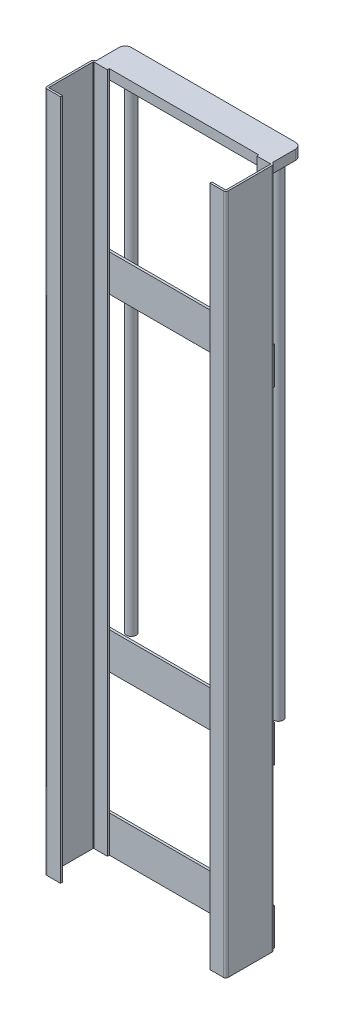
from build123d import *

# Parameters (mm, degrees)
BOSS_EXTRUDE1_DEPTH   = 2790
BOSS_EXTRUDE1_2_DEPTH = 2790
SKETCH4_W             = 722
SKETCH4_H             = 150
BOSS_EXTRUDE2_DEPTH   = 10
SKETCH5_R             = 20
BOSS_EXTRUDE3_DEPTH   = 40
SKETCH5_2_R           = 20
BOSS_EXTRUDE4_DEPTH   = 2040


with BuildPart() as part:
    # Sketch3 → Boss-Extrude1 (new body)
    with BuildSketch(Plane(origin=(0, 0, 0), x_dir=(1, 0, 0), z_dir=(0, 1, 0))):
        with BuildLine():
            Line((-306, 100), (-361, 100))
            ThreePointArc((-361, 100), (-368.071067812, 97.071067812), (-371, 90))
            Line((-371, 90), (-371, -90))
            ThreePointArc((-371, -90), (-368.071067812, -97.071067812), (-361, -100))
            Line((-361, -100), (-306, -100))
            Line((-306, -100), (-306, -92))
            Line((-306, -92), (-361, -92))
            ThreePointArc((-361, -92), (-362.414213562, -91.414213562), (-363, -90))
            Line((-363, -90), (-363, 90))
            ThreePointArc((-363, 90), (-362.414213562, 91.414213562), (-361, 92))
            Line((-361, 92), (-306, 92))
            Line((-306, 92), (-306, 100))
        make_face()
    extrude(amount=BOSS_EXTRUDE1_DEPTH)



with BuildPart() as body_2:
    # Sketch3 → Boss-Extrude1 2 (new body)
    with BuildSketch(Plane(origin=(0, 0, 0), x_dir=(1, 0, 0), z_dir=(0, 1, 0))):
        with BuildLine():
            Line((306, -92), (306, -100))
            Line((306, -100), (361, -100))
            ThreePointArc((361, -100), (368.071067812, -97.071067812), (371, -90))
            Line((371, -90), (371, 90))
            ThreePointArc((371, 90), (368.071067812, 97.071067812), (361, 100))
            Line((361, 100), (306, 100))
            Line((306, 100), (306, 92))
            Line((306, 92), (361, 92))
            ThreePointArc((361, 92), (362.414213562, 91.414213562), (363, 90))
            Line((363, 90), (363, -90))
            ThreePointArc((363, -90), (362.414213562, -91.414213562), (361, -92))
            Line((361, -92), (306, -92))
        make_face()
    extrude(amount=BOSS_EXTRUDE1_2_DEPTH)


with BuildPart() as part_1:
    add(part.part)

    add(body_2.part)  # Boss-Extrude2 merges body 2
    # Sketch4 → Boss-Extrude2 (add)
    with BuildSketch(Plane(origin=(0, 0, -100), x_dir=(-1, 0, 0), z_dir=(0, 0, -1))):
        with Locations((0, 75)):
            Rectangle(SKETCH4_W, SKETCH4_H)
        with Locations((0, 725)):
            Rectangle(SKETCH4_W, SKETCH4_H)
        with Locations((0, 2065)):
            Rectangle(SKETCH4_W, SKETCH4_H)
    extrude(amount=BOSS_EXTRUDE2_DEPTH)

    # Sketch5 → Boss-Extrude3 (add)
    with BuildSketch(Plane(origin=(0, 2790, 0), x_dir=(1, 0, 0), z_dir=(0, 1, 0))):
        with BuildLine():
            Line((361, 100), (361, 195))
            ThreePointArc((361, 195), (353.67766953, 212.67766953), (336, 220))
            Line((336, 220), (-336, 220))
            ThreePointArc((-336, 220), (-353.67766953, 212.67766953), (-361, 195))
            Line((-361, 195), (-361, 100))
            Line((-361, 100), (361, 100))
        make_face()
        with Locations(Location((301, 185, 0), (0, 0, 270))):
            Circle(SKETCH5_R, mode=Mode.SUBTRACT)
        with Locations(Location((-301, 185, 0), (0, 0, 90))):
            Circle(SKETCH5_R, mode=Mode.SUBTRACT)
    extrude(amount=-BOSS_EXTRUDE3_DEPTH)

    # Sketch5_2 → Boss-Extrude4 (add)
    with BuildSketch(Plane(origin=(0, 2790, 0), x_dir=(1, 0, 0), z_dir=(0, 1, 0))):
        with Locations(Location((301, 185, 0), (0, 0, 270))):
            Circle(SKETCH5_2_R)
        with Locations(Location((-301, 185, 0), (0, 0, 270))):
            Circle(SKETCH5_2_R)
    extrude(amount=-BOSS_EXTRUDE4_DEPTH)


solid = part_1.part
